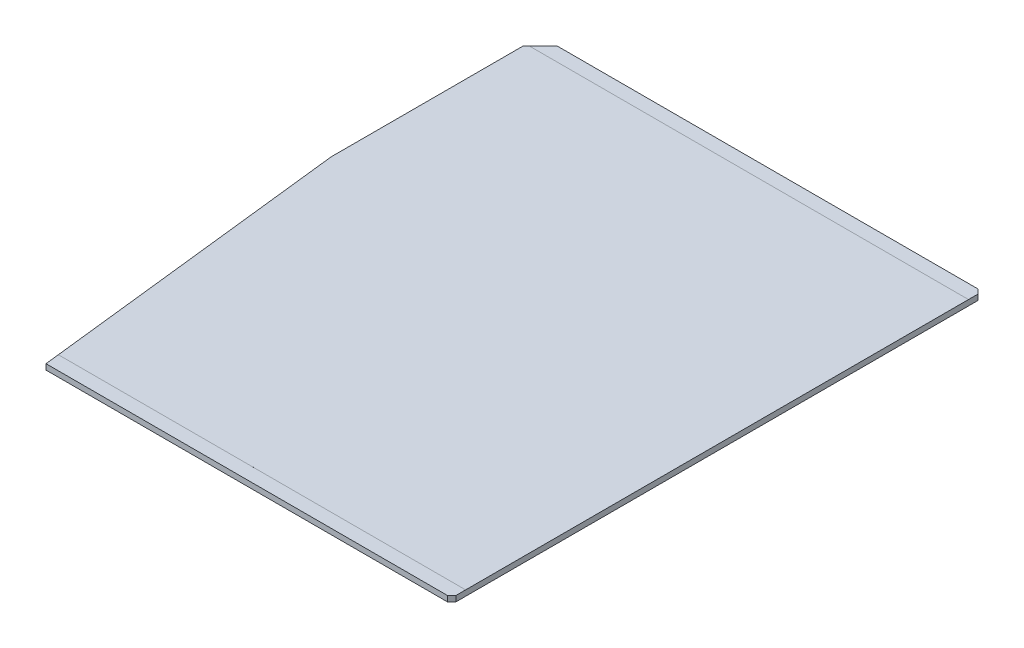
ISO-10303-21;
HEADER;
FILE_DESCRIPTION(('STEP AP214'),'2;1');
FILE_NAME('part.step','',(''),(''),'','','');
FILE_SCHEMA(('AUTOMOTIVE_DESIGN { 1 0 10303 214 1 1 1 1 }'));
ENDSEC;
DATA;
#1=APPLICATION_CONTEXT('core data for automotive mechanical design processes');
#2=APPLICATION_PROTOCOL_DEFINITION('international standard','automotive_design',2000,#1);
#3=PRODUCT_CONTEXT('',#1,'mechanical');
#4=PRODUCT('Part','Part','',(#3));
#5=PRODUCT_RELATED_PRODUCT_CATEGORY('part','',(#4));
#6=PRODUCT_DEFINITION_FORMATION('','',#4);
#7=PRODUCT_DEFINITION_CONTEXT('part definition',#1,'design');
#8=PRODUCT_DEFINITION('design','',#6,#7);
#9=PRODUCT_DEFINITION_SHAPE('','',#8);
#10=(LENGTH_UNIT() NAMED_UNIT(*) SI_UNIT(.MILLI.,.METRE.));
#11=(NAMED_UNIT(*) PLANE_ANGLE_UNIT() SI_UNIT($,.RADIAN.));
#12=(NAMED_UNIT(*) SI_UNIT($,.STERADIAN.) SOLID_ANGLE_UNIT());
#13=UNCERTAINTY_MEASURE_WITH_UNIT(LENGTH_MEASURE(1.E-05),#10,'distance_accuracy_value','');
#14=(GEOMETRIC_REPRESENTATION_CONTEXT(3) GLOBAL_UNCERTAINTY_ASSIGNED_CONTEXT((#13)) GLOBAL_UNIT_ASSIGNED_CONTEXT((#10,
#11,#12)) REPRESENTATION_CONTEXT('',''));
#15=CARTESIAN_POINT('',(0.,0.,0.));
#16=DIRECTION('',(0.,0.,1.));
#17=DIRECTION('',(1.,0.,0.));
#18=AXIS2_PLACEMENT_3D('',#15,#16,#17);
#19=CARTESIAN_POINT('',(-63.5,1.6,76.2));
#20=DIRECTION('',(0.,0.,-1.));
#21=DIRECTION('',(-1.,0.,0.));
#22=AXIS2_PLACEMENT_3D('',#19,#20,#21);
#23=PLANE('',#22);
#24=DIRECTION('',(0.,-1.,0.));
#25=VECTOR('',#24,1.);
#26=CARTESIAN_POINT('',(-53.,249.583617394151,76.2));
#27=LINE('',#26,#25);
#28=CARTESIAN_POINT('',(-53.,1.5999,76.2));
#29=VERTEX_POINT('',#28);
#30=CARTESIAN_POINT('',(-53.,0.,76.2));
#31=VERTEX_POINT('',#30);
#32=EDGE_CURVE('E46',#29,#31,#27,.T.);
#33=ORIENTED_EDGE('',*,*,#32,.T.);
#34=DIRECTION('',(1.,0.,0.));
#35=VECTOR('',#34,1.);
#36=CARTESIAN_POINT('',(-63.5,0.,76.2));
#37=LINE('',#36,#35);
#38=CARTESIAN_POINT('',(62.2300000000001,0.,76.2));
#39=VERTEX_POINT('',#38);
#40=EDGE_CURVE('E130',#31,#39,#37,.T.);
#41=ORIENTED_EDGE('',*,*,#40,.T.);
#42=DIRECTION('',(0.,1.,0.));
#43=VECTOR('',#42,1.);
#44=CARTESIAN_POINT('',(62.2300000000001,1.6,76.2));
#45=LINE('',#44,#43);
#46=CARTESIAN_POINT('',(62.2300000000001,1.5999,76.2));
#47=VERTEX_POINT('',#46);
#48=EDGE_CURVE('E167',#39,#47,#45,.T.);
#49=ORIENTED_EDGE('',*,*,#48,.T.);
#50=DIRECTION('',(1.,0.,0.));
#51=VECTOR('',#50,1.);
#52=CARTESIAN_POINT('',(-63.5,1.5999,76.2));
#53=LINE('',#52,#51);
#54=EDGE_CURVE('E52',#29,#47,#53,.T.);
#55=ORIENTED_EDGE('',*,*,#54,.F.);
#56=EDGE_LOOP('',(#33,#41,#49,#55));
#57=FACE_BOUND('',#56,.T.);
#58=ADVANCED_FACE('F31',(#57),#23,.F.);
#59=CARTESIAN_POINT('',(63.5,1.6,76.2));
#60=DIRECTION('',(0.,1.,0.));
#61=DIRECTION('',(0.,0.,1.));
#62=AXIS2_PLACEMENT_3D('',#59,#60,#61);
#63=PLANE('',#62);
#64=DIRECTION('',(0.,0.,1.));
#65=VECTOR('',#64,1.);
#66=CARTESIAN_POINT('',(-63.5,1.6,-76.2));
#67=LINE('',#66,#65);
#68=CARTESIAN_POINT('',(-63.5,1.6,-71.2));
#69=VERTEX_POINT('',#68);
#70=CARTESIAN_POINT('',(-63.5,1.59999999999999,-16.2));
#71=VERTEX_POINT('',#70);
#72=EDGE_CURVE('E142',#69,#71,#67,.T.);
#73=ORIENTED_EDGE('',*,*,#72,.T.);
#74=DIRECTION('',(0.112909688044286,0.,0.993605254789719));
#75=VECTOR('',#74,1.);
#76=CARTESIAN_POINT('',(-51.514788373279,1.6,89.2698623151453));
#77=LINE('',#76,#75);
#78=CARTESIAN_POINT('',(-53.4545454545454,1.6,72.2));
#79=VERTEX_POINT('',#78);
#80=EDGE_CURVE('E126',#71,#79,#77,.T.);
#81=ORIENTED_EDGE('',*,*,#80,.T.);
#82=DIRECTION('',(1.,0.,0.));
#83=VECTOR('',#82,1.);
#84=CARTESIAN_POINT('',(72.4805203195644,1.6,72.2));
#85=LINE('',#84,#83);
#86=CARTESIAN_POINT('',(63.5,1.6,72.2));
#87=VERTEX_POINT('',#86);
#88=EDGE_CURVE('E193',#79,#87,#85,.T.);
#89=ORIENTED_EDGE('',*,*,#88,.T.);
#90=DIRECTION('',(0.,0.,-1.));
#91=VECTOR('',#90,1.);
#92=CARTESIAN_POINT('',(63.5,1.6,-76.2));
#93=LINE('',#92,#91);
#94=CARTESIAN_POINT('',(63.5,1.6,-72.2));
#95=VERTEX_POINT('',#94);
#96=EDGE_CURVE('E138',#87,#95,#93,.T.);
#97=ORIENTED_EDGE('',*,*,#96,.T.);
#98=DIRECTION('',(-1.,0.,0.));
#99=VECTOR('',#98,1.);
#100=CARTESIAN_POINT('',(72.4805203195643,1.6,-72.2));
#101=LINE('',#100,#99);
#102=CARTESIAN_POINT('',(-62.5,1.6,-72.2));
#103=VERTEX_POINT('',#102);
#104=EDGE_CURVE('E125',#95,#103,#101,.T.);
#105=ORIENTED_EDGE('',*,*,#104,.T.);
#106=DIRECTION('',(0.707106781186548,0.,-0.707106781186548));
#107=VECTOR('',#106,1.);
#108=CARTESIAN_POINT('',(-73.7,1.6,-61.));
#109=LINE('',#108,#107);
#110=EDGE_CURVE('E157',#103,#69,#109,.F.);
#111=ORIENTED_EDGE('',*,*,#110,.T.);
#112=EDGE_LOOP('',(#73,#81,#89,#97,#105,#111));
#113=FACE_BOUND('',#112,.T.);
#114=ADVANCED_FACE('F190',(#113),#63,.T.);
#115=CARTESIAN_POINT('',(-63.5,1.6,-76.2));
#116=DIRECTION('',(1.,0.,0.));
#117=DIRECTION('',(0.,0.,-1.));
#118=AXIS2_PLACEMENT_3D('',#115,#116,#117);
#119=PLANE('',#118);
#120=DIRECTION('',(0.,-1.,0.));
#121=VECTOR('',#120,1.);
#122=CARTESIAN_POINT('',(-63.5,249.583617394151,-16.2));
#123=LINE('',#122,#121);
#124=CARTESIAN_POINT('',(-63.5,0.,-16.2));
#125=VERTEX_POINT('',#124);
#126=EDGE_CURVE('E120',#71,#125,#123,.T.);
#127=ORIENTED_EDGE('',*,*,#126,.F.);
#128=ORIENTED_EDGE('',*,*,#72,.F.);
#129=DIRECTION('',(0.,-1.,0.));
#130=VECTOR('',#129,1.);
#131=CARTESIAN_POINT('',(-63.5,1.6,-71.2));
#132=LINE('',#131,#130);
#133=CARTESIAN_POINT('',(-63.5,0.,-71.2));
#134=VERTEX_POINT('',#133);
#135=EDGE_CURVE('E148',#69,#134,#132,.T.);
#136=ORIENTED_EDGE('',*,*,#135,.T.);
#137=DIRECTION('',(0.,0.,1.));
#138=VECTOR('',#137,1.);
#139=CARTESIAN_POINT('',(-63.5,0.,-76.2));
#140=LINE('',#139,#138);
#141=EDGE_CURVE('E139',#134,#125,#140,.T.);
#142=ORIENTED_EDGE('',*,*,#141,.T.);
#143=EDGE_LOOP('',(#127,#128,#136,#142));
#144=FACE_BOUND('',#143,.T.);
#145=ADVANCED_FACE('F224',(#144),#119,.F.);
#146=CARTESIAN_POINT('',(63.5,0.,76.2));
#147=DIRECTION('',(0.,1.,0.));
#148=DIRECTION('',(0.,0.,1.));
#149=AXIS2_PLACEMENT_3D('',#146,#147,#148);
#150=PLANE('',#149);
#151=DIRECTION('',(0.112909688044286,0.,0.993605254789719));
#152=VECTOR('',#151,1.);
#153=CARTESIAN_POINT('',(-51.514788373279,0.,89.2698623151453));
#154=LINE('',#153,#152);
#155=EDGE_CURVE('E117',#125,#31,#154,.T.);
#156=ORIENTED_EDGE('',*,*,#155,.F.);
#157=ORIENTED_EDGE('',*,*,#141,.F.);
#158=DIRECTION('',(-0.707106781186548,0.,0.707106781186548));
#159=VECTOR('',#158,1.);
#160=CARTESIAN_POINT('',(-63.5,0.,-71.2));
#161=LINE('',#160,#159);
#162=CARTESIAN_POINT('',(-58.5,0.,-76.2));
#163=VERTEX_POINT('',#162);
#164=EDGE_CURVE('E151',#134,#163,#161,.F.);
#165=ORIENTED_EDGE('',*,*,#164,.T.);
#166=DIRECTION('',(-1.,0.,0.));
#167=VECTOR('',#166,1.);
#168=CARTESIAN_POINT('',(-63.5,0.,-76.2));
#169=LINE('',#168,#167);
#170=CARTESIAN_POINT('',(62.23,0.,-76.2));
#171=VERTEX_POINT('',#170);
#172=EDGE_CURVE('E144',#171,#163,#169,.T.);
#173=ORIENTED_EDGE('',*,*,#172,.F.);
#174=DIRECTION('',(-0.70710678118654,0.,-0.707106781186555));
#175=VECTOR('',#174,1.);
#176=CARTESIAN_POINT('',(62.23,0.,-76.2));
#177=LINE('',#176,#175);
#178=CARTESIAN_POINT('',(63.5,0.,-74.93));
#179=VERTEX_POINT('',#178);
#180=EDGE_CURVE('E164',#171,#179,#177,.F.);
#181=ORIENTED_EDGE('',*,*,#180,.T.);
#182=DIRECTION('',(0.,0.,-1.));
#183=VECTOR('',#182,1.);
#184=CARTESIAN_POINT('',(63.5,0.,-76.2));
#185=LINE('',#184,#183);
#186=CARTESIAN_POINT('',(63.5,0.,74.9300000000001));
#187=VERTEX_POINT('',#186);
#188=EDGE_CURVE('E213',#187,#179,#185,.T.);
#189=ORIENTED_EDGE('',*,*,#188,.F.);
#190=DIRECTION('',(0.70710678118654,0.,-0.707106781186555));
#191=VECTOR('',#190,1.);
#192=CARTESIAN_POINT('',(63.5,0.,74.9300000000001));
#193=LINE('',#192,#191);
#194=EDGE_CURVE('E136',#187,#39,#193,.F.);
#195=ORIENTED_EDGE('',*,*,#194,.T.);
#196=ORIENTED_EDGE('',*,*,#40,.F.);
#197=EDGE_LOOP('',(#156,#157,#165,#173,#181,#189,#195,#196));
#198=FACE_BOUND('',#197,.T.);
#199=ADVANCED_FACE('F133',(#198),#150,.F.);
#200=CARTESIAN_POINT('',(72.4805203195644,1.5999,72.2));
#201=DIRECTION('',(0.,0.,1.));
#202=DIRECTION('',(1.,0.,0.));
#203=AXIS2_PLACEMENT_3D('',#200,#201,#202);
#204=PLANE('',#203);
#205=ORIENTED_EDGE('',*,*,#88,.F.);
#206=DIRECTION('',(0.,-1.,0.));
#207=VECTOR('',#206,1.);
#208=CARTESIAN_POINT('',(-53.4545454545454,1.5999,72.2));
#209=LINE('',#208,#207);
#210=CARTESIAN_POINT('',(-53.4545454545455,1.5999,72.2));
#211=VERTEX_POINT('',#210);
#212=EDGE_CURVE('E227',#79,#211,#209,.T.);
#213=ORIENTED_EDGE('',*,*,#212,.T.);
#214=DIRECTION('',(1.,0.,0.));
#215=VECTOR('',#214,1.);
#216=CARTESIAN_POINT('',(72.4805203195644,1.5999,72.2));
#217=LINE('',#216,#215);
#218=CARTESIAN_POINT('',(63.5,1.5999,72.2));
#219=VERTEX_POINT('',#218);
#220=EDGE_CURVE('E197',#211,#219,#217,.T.);
#221=ORIENTED_EDGE('',*,*,#220,.T.);
#222=DIRECTION('',(0.,1.,0.));
#223=VECTOR('',#222,1.);
#224=CARTESIAN_POINT('',(63.5,1.6,72.2));
#225=LINE('',#224,#223);
#226=EDGE_CURVE('E209',#219,#87,#225,.T.);
#227=ORIENTED_EDGE('',*,*,#226,.T.);
#228=EDGE_LOOP('',(#205,#213,#221,#227));
#229=FACE_BOUND('',#228,.T.);
#230=ADVANCED_FACE('F231',(#229),#204,.T.);
#231=CARTESIAN_POINT('',(-0.842207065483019,1.5999,0.));
#232=DIRECTION('',(0.,1.,0.));
#233=DIRECTION('',(0.,0.,1.));
#234=AXIS2_PLACEMENT_3D('',#231,#232,#233);
#235=PLANE('',#234);
#236=ORIENTED_EDGE('',*,*,#220,.F.);
#237=DIRECTION('',(0.112909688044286,0.,0.993605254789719));
#238=VECTOR('',#237,1.);
#239=CARTESIAN_POINT('',(-60.883760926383,1.5999,6.82290384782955));
#240=LINE('',#239,#238);
#241=EDGE_CURVE('E12',#211,#29,#240,.T.);
#242=ORIENTED_EDGE('',*,*,#241,.T.);
#243=ORIENTED_EDGE('',*,*,#54,.T.);
#244=DIRECTION('',(0.70710678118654,0.,-0.707106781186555));
#245=VECTOR('',#244,1.);
#246=CARTESIAN_POINT('',(63.5,1.5999,74.9300000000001));
#247=LINE('',#246,#245);
#248=CARTESIAN_POINT('',(63.5,1.5999,74.9300000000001));
#249=VERTEX_POINT('',#248);
#250=EDGE_CURVE('E206',#249,#47,#247,.F.);
#251=ORIENTED_EDGE('',*,*,#250,.F.);
#252=DIRECTION('',(0.,0.,-1.));
#253=VECTOR('',#252,1.);
#254=CARTESIAN_POINT('',(63.5,1.5999,-76.2));
#255=LINE('',#254,#253);
#256=EDGE_CURVE('E204',#249,#219,#255,.T.);
#257=ORIENTED_EDGE('',*,*,#256,.T.);
#258=EDGE_LOOP('',(#236,#242,#243,#251,#257));
#259=FACE_BOUND('',#258,.T.);
#260=ADVANCED_FACE('F248',(#259),#235,.T.);
#261=CARTESIAN_POINT('',(63.5,1.6,-76.2));
#262=DIRECTION('',(-1.,0.,0.));
#263=DIRECTION('',(0.,0.,1.));
#264=AXIS2_PLACEMENT_3D('',#261,#262,#263);
#265=PLANE('',#264);
#266=ORIENTED_EDGE('',*,*,#256,.F.);
#267=DIRECTION('',(0.,-1.,0.));
#268=VECTOR('',#267,1.);
#269=CARTESIAN_POINT('',(63.5,1.6,74.9300000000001));
#270=LINE('',#269,#268);
#271=EDGE_CURVE('E162',#249,#187,#270,.T.);
#272=ORIENTED_EDGE('',*,*,#271,.T.);
#273=ORIENTED_EDGE('',*,*,#188,.T.);
#274=DIRECTION('',(0.,1.,0.));
#275=VECTOR('',#274,1.);
#276=CARTESIAN_POINT('',(63.5,1.6,-74.93));
#277=LINE('',#276,#275);
#278=CARTESIAN_POINT('',(63.5,1.5999,-74.93));
#279=VERTEX_POINT('',#278);
#280=EDGE_CURVE('E159',#179,#279,#277,.T.);
#281=ORIENTED_EDGE('',*,*,#280,.T.);
#282=CARTESIAN_POINT('',(63.5,1.5999,-72.2));
#283=VERTEX_POINT('',#282);
#284=EDGE_CURVE('E202',#283,#279,#255,.T.);
#285=ORIENTED_EDGE('',*,*,#284,.F.);
#286=DIRECTION('',(0.,-1.,0.));
#287=VECTOR('',#286,1.);
#288=CARTESIAN_POINT('',(63.5,1.6,-72.2));
#289=LINE('',#288,#287);
#290=EDGE_CURVE('E212',#95,#283,#289,.T.);
#291=ORIENTED_EDGE('',*,*,#290,.F.);
#292=ORIENTED_EDGE('',*,*,#96,.F.);
#293=ORIENTED_EDGE('',*,*,#226,.F.);
#294=EDGE_LOOP('',(#266,#272,#273,#281,#285,#291,#292,#293));
#295=FACE_BOUND('',#294,.T.);
#296=ADVANCED_FACE('F237',(#295),#265,.F.);
#297=CARTESIAN_POINT('',(-63.5,1.6,-76.2));
#298=DIRECTION('',(0.,0.,1.));
#299=DIRECTION('',(1.,0.,0.));
#300=AXIS2_PLACEMENT_3D('',#297,#298,#299);
#301=PLANE('',#300);
#302=DIRECTION('',(-1.,0.,0.));
#303=VECTOR('',#302,1.);
#304=CARTESIAN_POINT('',(-63.5,1.5999,-76.2));
#305=LINE('',#304,#303);
#306=CARTESIAN_POINT('',(62.23,1.5999,-76.2));
#307=VERTEX_POINT('',#306);
#308=CARTESIAN_POINT('',(-58.5,1.5999,-76.2));
#309=VERTEX_POINT('',#308);
#310=EDGE_CURVE('E200',#307,#309,#305,.T.);
#311=ORIENTED_EDGE('',*,*,#310,.F.);
#312=DIRECTION('',(0.,-1.,0.));
#313=VECTOR('',#312,1.);
#314=CARTESIAN_POINT('',(62.23,1.6,-76.2));
#315=LINE('',#314,#313);
#316=EDGE_CURVE('E169',#307,#171,#315,.T.);
#317=ORIENTED_EDGE('',*,*,#316,.T.);
#318=ORIENTED_EDGE('',*,*,#172,.T.);
#319=DIRECTION('',(0.,1.,0.));
#320=VECTOR('',#319,1.);
#321=CARTESIAN_POINT('',(-58.5,1.6,-76.2));
#322=LINE('',#321,#320);
#323=EDGE_CURVE('E154',#163,#309,#322,.T.);
#324=ORIENTED_EDGE('',*,*,#323,.T.);
#325=EDGE_LOOP('',(#311,#317,#318,#324));
#326=FACE_BOUND('',#325,.T.);
#327=ADVANCED_FACE('F220',(#326),#301,.F.);
#328=CARTESIAN_POINT('',(-63.5,1.6,-71.2));
#329=DIRECTION('',(0.707106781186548,0.,0.707106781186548));
#330=DIRECTION('',(0.707106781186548,0.,-0.707106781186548));
#331=AXIS2_PLACEMENT_3D('',#328,#329,#330);
#332=PLANE('',#331);
#333=DIRECTION('',(0.,1.,0.));
#334=VECTOR('',#333,1.);
#335=CARTESIAN_POINT('',(-62.5,1.6,-72.2));
#336=LINE('',#335,#334);
#337=CARTESIAN_POINT('',(-62.5,1.5999,-72.2));
#338=VERTEX_POINT('',#337);
#339=EDGE_CURVE('E39',#103,#338,#336,.F.);
#340=ORIENTED_EDGE('',*,*,#339,.T.);
#341=DIRECTION('',(-0.707106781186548,0.,0.707106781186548));
#342=VECTOR('',#341,1.);
#343=CARTESIAN_POINT('',(-63.5,1.5999,-71.2));
#344=LINE('',#343,#342);
#345=EDGE_CURVE('E179',#338,#309,#344,.F.);
#346=ORIENTED_EDGE('',*,*,#345,.T.);
#347=ORIENTED_EDGE('',*,*,#323,.F.);
#348=ORIENTED_EDGE('',*,*,#164,.F.);
#349=ORIENTED_EDGE('',*,*,#135,.F.);
#350=ORIENTED_EDGE('',*,*,#110,.F.);
#351=EDGE_LOOP('',(#340,#346,#347,#348,#349,#350));
#352=FACE_BOUND('',#351,.T.);
#353=ADVANCED_FACE('F177',(#352),#332,.F.);
#354=CARTESIAN_POINT('',(63.5,1.6,74.9300000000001));
#355=DIRECTION('',(-0.707106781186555,0.,-0.70710678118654));
#356=DIRECTION('',(-0.70710678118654,0.,0.707106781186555));
#357=AXIS2_PLACEMENT_3D('',#354,#355,#356);
#358=PLANE('',#357);
#359=ORIENTED_EDGE('',*,*,#271,.F.);
#360=ORIENTED_EDGE('',*,*,#250,.T.);
#361=ORIENTED_EDGE('',*,*,#48,.F.);
#362=ORIENTED_EDGE('',*,*,#194,.F.);
#363=EDGE_LOOP('',(#359,#360,#361,#362));
#364=FACE_BOUND('',#363,.T.);
#365=ADVANCED_FACE('F247',(#364),#358,.F.);
#366=CARTESIAN_POINT('',(62.23,1.6,-76.2));
#367=DIRECTION('',(-0.707106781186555,0.,0.70710678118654));
#368=DIRECTION('',(0.70710678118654,0.,0.707106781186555));
#369=AXIS2_PLACEMENT_3D('',#366,#367,#368);
#370=PLANE('',#369);
#371=ORIENTED_EDGE('',*,*,#316,.F.);
#372=DIRECTION('',(-0.70710678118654,0.,-0.707106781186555));
#373=VECTOR('',#372,1.);
#374=CARTESIAN_POINT('',(62.23,1.5999,-76.2));
#375=LINE('',#374,#373);
#376=EDGE_CURVE('E171',#307,#279,#375,.F.);
#377=ORIENTED_EDGE('',*,*,#376,.T.);
#378=ORIENTED_EDGE('',*,*,#280,.F.);
#379=ORIENTED_EDGE('',*,*,#180,.F.);
#380=EDGE_LOOP('',(#371,#377,#378,#379));
#381=FACE_BOUND('',#380,.T.);
#382=ADVANCED_FACE('F33',(#381),#370,.F.);
#383=DIRECTION('',(-1.,0.,0.));
#384=VECTOR('',#383,1.);
#385=CARTESIAN_POINT('',(72.4805203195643,1.5999,-72.2));
#386=LINE('',#385,#384);
#387=EDGE_CURVE('E187',#283,#338,#386,.T.);
#388=ORIENTED_EDGE('',*,*,#387,.F.);
#389=ORIENTED_EDGE('',*,*,#284,.T.);
#390=ORIENTED_EDGE('',*,*,#376,.F.);
#391=ORIENTED_EDGE('',*,*,#310,.T.);
#392=ORIENTED_EDGE('',*,*,#345,.F.);
#393=EDGE_LOOP('',(#388,#389,#390,#391,#392));
#394=FACE_BOUND('',#393,.T.);
#395=ADVANCED_FACE('F240',(#394),#235,.T.);
#396=CARTESIAN_POINT('',(72.4805203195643,1.5999,-72.2));
#397=DIRECTION('',(0.,0.,-1.));
#398=DIRECTION('',(-1.,0.,0.));
#399=AXIS2_PLACEMENT_3D('',#396,#397,#398);
#400=PLANE('',#399);
#401=ORIENTED_EDGE('',*,*,#290,.T.);
#402=ORIENTED_EDGE('',*,*,#387,.T.);
#403=ORIENTED_EDGE('',*,*,#339,.F.);
#404=ORIENTED_EDGE('',*,*,#104,.F.);
#405=EDGE_LOOP('',(#401,#402,#403,#404));
#406=FACE_BOUND('',#405,.T.);
#407=ADVANCED_FACE('F184',(#406),#400,.T.);
#408=CARTESIAN_POINT('',(-53.,249.583617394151,76.2));
#409=DIRECTION('',(-0.993605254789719,0.,0.112909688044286));
#410=DIRECTION('',(0.112909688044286,0.,0.993605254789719));
#411=AXIS2_PLACEMENT_3D('',#408,#409,#410);
#412=PLANE('',#411);
#413=ORIENTED_EDGE('',*,*,#126,.T.);
#414=ORIENTED_EDGE('',*,*,#155,.T.);
#415=ORIENTED_EDGE('',*,*,#32,.F.);
#416=ORIENTED_EDGE('',*,*,#241,.F.);
#417=ORIENTED_EDGE('',*,*,#212,.F.);
#418=ORIENTED_EDGE('',*,*,#80,.F.);
#419=EDGE_LOOP('',(#413,#414,#415,#416,#417,#418));
#420=FACE_BOUND('',#419,.T.);
#421=ADVANCED_FACE('F118',(#420),#412,.T.);
#422=CLOSED_SHELL('',(#58,#114,#145,#199,#230,#260,#296,#327,#353,#365,#382,#395,#407,#421));
#423=MANIFOLD_SOLID_BREP('B2',#422);
#424=ADVANCED_BREP_SHAPE_REPRESENTATION('',(#18,#423),#14);
#425=SHAPE_DEFINITION_REPRESENTATION(#9,#424);
ENDSEC;
END-ISO-10303-21;
